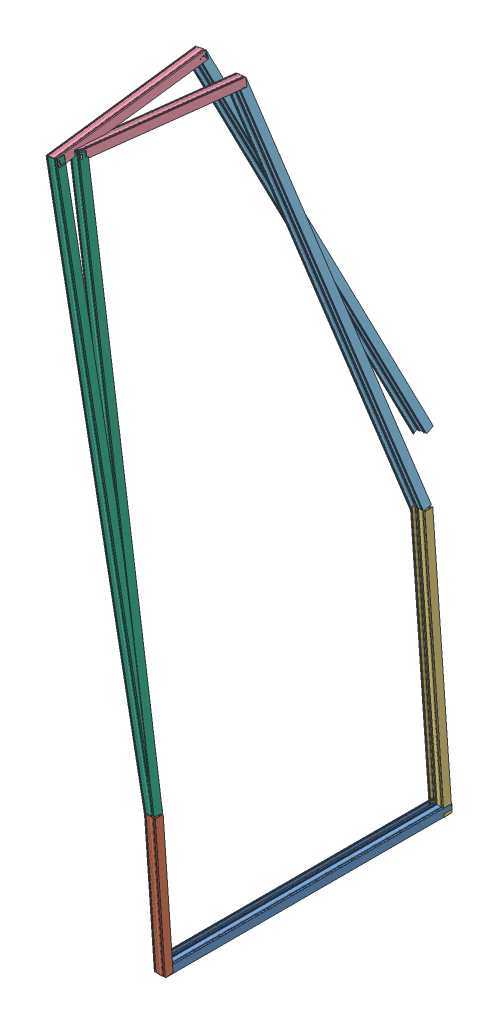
SolidWorks assembly Fenster 2.SLDASM, configuration Standard (file format 5000). Lengths in mm.
Overall size (790.78 4521.35 2050.83).
11 component instances, 6 part files, 19 mates.
Components (placement in the parent):
- Fenster unten-1: Fenster unten.SLDASM [Standard] at (314.0614 -363.1295 233.2677) size (75 1895.89 2043.64)
  - Rahmen 1-1: Rahmen 1.SLDPRT [Standard] at (-34.4668 -47.0827 -987.5) size (75 79 1975)
  - Rahmen 2-1: Rahmen 2.SLDPRT [Standard] at (-34.4668 -47.0827 987.5) x (1 0 0) z (0 0.997564 0.069756) size (75 79 984)
  - Rahmen 3-1: Rahmen 3.SLDPRT [Standard] at (-34.4668 1843.3012 -855.3115) x (1 0 0) z (0 -0.997564 -0.069756) size (75 79 1895)
- Fenster oben-1: Fenster oben.SLDASM [Standard] at (-451.6829 4175.3707 703.3034) x (0.978148 0.207405 0.014503) z (-0.010881 0.120728 -0.992626) size (75 3571.01 2259.27) (hidden)
  - Rahmen 4-1: Rahmen 4.SLDPRT [Standard] at (-25.0919 19.645 -524.5) size (75 79 1049)
  - Rahmen 5-1: Rahmen 5.SLDPRT [Standard] at (-25.0919 19.645 524.5) x (1 0 0) z (0 0.965926 0.258819) size (75 79 2743)
  - Rahmen 6-1: Rahmen 6.SLDPRT [Standard] at (-25.0919 3480.6319 -1010.91) x (1 0 0) z (0 -0.990268 0.139173) size (75 79 3595)
- Rahmen 4-1: Rahmen 4.SLDPRT [Standard] at (-429.8144 4090.4965 1097.9412) x (0.974738 0.201713 0.095903) z (0.102046 -0.020256 -0.994573) size (75 79 1049)
- Rahmen 5-1: Rahmen 5.SLDPRT [Standard] at (-322.7682 4069.2479 54.6337) x (0.974738 0.201713 0.095903) z (0.2196 -0.943885 -0.246692) size (75 79 2743)
- Rahmen 6-1: Rahmen 6.SLDPRT [Standard] at (259.8614 669.2798 1284.0822) x (0.974738 0.201713 0.095903) z (-0.197332 0.978889 -0.053259) size (75 79 3595)
Mates (geometry in assembly coordinates):
- Deckungsgleich10: coincident anti-aligned: plane of Fenster unten-1/Rahmen 2-1 through (279.5946 571.3909 1289.4081) normal (0 0.997564 0.069756); plane of Fenster oben-1
- Deckungsgleich11: coincident: plane of Fenster unten-1/Rahmen 2-1 through (279.5946 571.3909 1289.4081) normal (0 -0.069756 0.997564); line of Fenster oben-1/Rahmen 6-1 through (281.4836 572.096 1289.4574) axis (-0.978148 -0.207405 -0.014503)
- Deckungsgleich12: coincident: plane of Fenster unten-1/Rahmen 2-1 through (279.5946 571.3909 1289.4081) normal (-1 0 0); point of Fenster oben-1/Rahmen 6-1
- Deckungsgleich13: coincident: point of Fenster unten-1/Rahmen 2-1; point of Rahmen 6-1
- Deckungsgleich27: coincident anti-aligned: plane of Fenster unten-1/Rahmen 2-1 through (279.5946 571.3909 1289.4081) normal (0 0.997564 0.069756); plane of Rahmen 6-1
- Deckungsgleich29: coincident: plane of Fenster unten-1/Rahmen 3-1 through (279.5946 1480.1717 -622.0437) normal (0 0.997564 0.069756); plane of Rahmen 5-1
- Deckungsgleich40: coincident: plane of Fenster unten-1/Rahmen 2-1 through (279.5946 571.3909 1289.4081) normal (-1 0 0); point of Rahmen 6-1
- Deckungsgleich53: coincident: plane of Fenster unten-1/Rahmen 3-1 through (279.5946 -410.2122 -754.2323) normal (-1 0 0); point of Rahmen 5-1
- Deckungsgleich54: coincident: point of Fenster unten-1/Rahmen 3-1; point of Rahmen 5-1
- Deckungsgleich55: coincident: point of Rahmen 4-1; plane of Rahmen 5-1 through (279.5946 1480.1717 -622.0437) normal (-0.974738 -0.201713 -0.095903)
- Deckungsgleich56: coincident: point of Rahmen 4-1; plane of Rahmen 5-1 through (279.5946 1480.1717 -622.0437) normal (0.04076 0.261521 -0.964337)
- Deckungsgleich57: coincident: point of Rahmen 4-1; plane of Rahmen 5-1 through (-322.7682 4069.2479 54.6337) normal (-0.2196 0.943885 0.246692)
- Deckungsgleich58: coincident: point of Rahmen 4-1; plane of Rahmen 6-1 through (279.5946 571.3909 1289.4081) normal (-0.974738 -0.201713 -0.095903)
- Deckungsgleich59: coincident: point of Rahmen 4-1; plane of Rahmen 5-1 through (279.5946 1480.1717 -622.0437) normal (-0.974738 -0.201713 -0.095903)
- Deckungsgleich62: coincident: point of Rahmen 4-1; point of Rahmen 6-1
- Deckungsgleich63: coincident aligned: plane of Rahmen 4-1 through (-322.7682 4069.2479 54.6337) normal (-0.974738 -0.201713 -0.095903); plane of Rahmen 6-1 through (279.5946 571.3909 1289.4081) normal (-0.974738 -0.201713 -0.095903)
- Parallel1: parallel aligned: plane of Rahmen 5-1 through (279.5946 1480.1717 -622.0437) normal (-0.974738 -0.201713 -0.095903); plane of Rahmen 6-1 through (279.5946 571.3909 1289.4081) normal (-0.974738 -0.201713 -0.095903)
- Deckungsgleich66: coincident: plane of Fenster unten-1/Rahmen 2-1 through (279.5946 571.3909 1289.4081) normal (0 -0.069756 0.997564); point of Rahmen 6-1
- Deckungsgleich67: coincident: plane of Fenster unten-1/Rahmen 2-1 through (279.5946 571.3909 1289.4081) normal (-1 0 0); point of Rahmen 6-1
